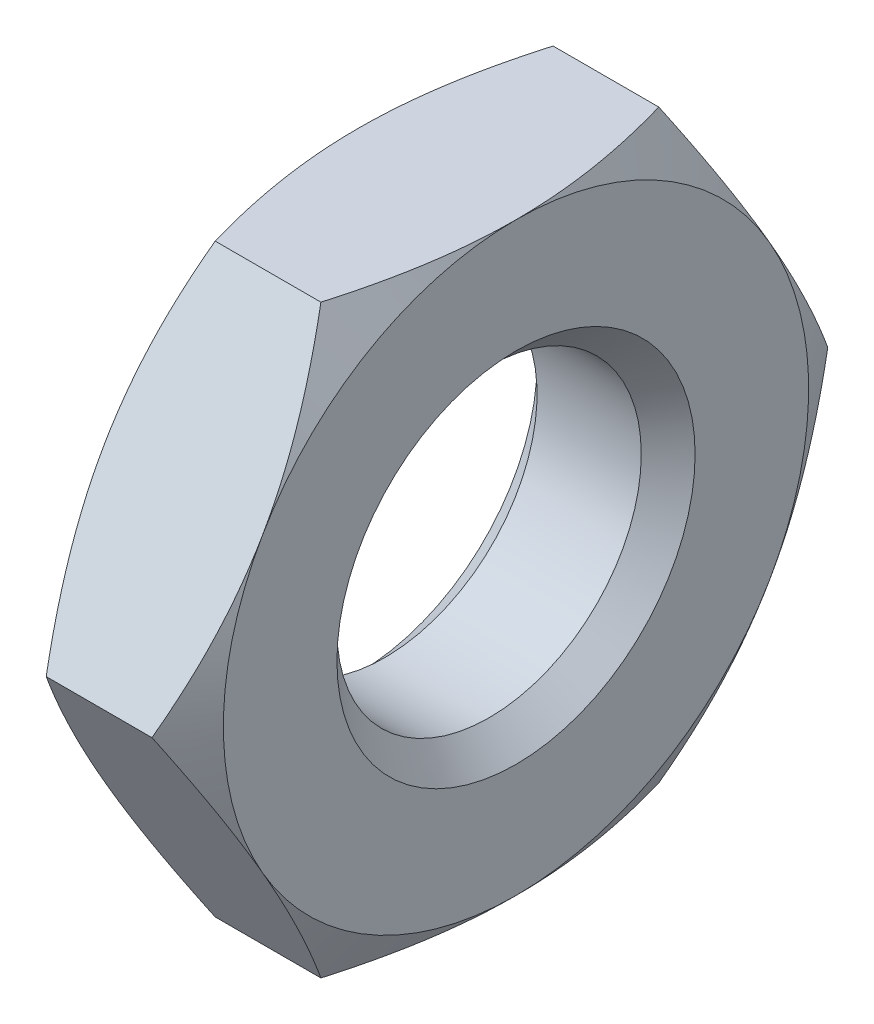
ISO-10303-21;
HEADER;
FILE_DESCRIPTION(('STEP AP214'),'2;1');
FILE_NAME('part.step','',(''),(''),'','','');
FILE_SCHEMA(('AUTOMOTIVE_DESIGN { 1 0 10303 214 1 1 1 1 }'));
ENDSEC;
DATA;
#1=APPLICATION_CONTEXT('core data for automotive mechanical design processes');
#2=APPLICATION_PROTOCOL_DEFINITION('international standard','automotive_design',2000,#1);
#3=PRODUCT_CONTEXT('',#1,'mechanical');
#4=PRODUCT('Part','Part','',(#3));
#5=PRODUCT_RELATED_PRODUCT_CATEGORY('part','',(#4));
#6=PRODUCT_DEFINITION_FORMATION('','',#4);
#7=PRODUCT_DEFINITION_CONTEXT('part definition',#1,'design');
#8=PRODUCT_DEFINITION('design','',#6,#7);
#9=PRODUCT_DEFINITION_SHAPE('','',#8);
#10=(LENGTH_UNIT() NAMED_UNIT(*) SI_UNIT(.MILLI.,.METRE.));
#11=(NAMED_UNIT(*) PLANE_ANGLE_UNIT() SI_UNIT($,.RADIAN.));
#12=(NAMED_UNIT(*) SI_UNIT($,.STERADIAN.) SOLID_ANGLE_UNIT());
#13=UNCERTAINTY_MEASURE_WITH_UNIT(LENGTH_MEASURE(1.E-05),#10,'distance_accuracy_value','');
#14=(GEOMETRIC_REPRESENTATION_CONTEXT(3) GLOBAL_UNCERTAINTY_ASSIGNED_CONTEXT((#13)) GLOBAL_UNIT_ASSIGNED_CONTEXT((#10,
#11,#12)) REPRESENTATION_CONTEXT('',''));
#15=CARTESIAN_POINT('',(0.,0.,0.));
#16=DIRECTION('',(0.,0.,1.));
#17=DIRECTION('',(1.,0.,0.));
#18=AXIS2_PLACEMENT_3D('',#15,#16,#17);
#19=CARTESIAN_POINT('',(1.35,2.5,-1.44337567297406));
#20=DIRECTION('',(1.,0.,0.));
#21=DIRECTION('',(0.,0.,-1.));
#22=AXIS2_PLACEMENT_3D('',#19,#20,#21);
#23=PLANE('',#22);
#24=CARTESIAN_POINT('',(1.35,0.,0.));
#25=DIRECTION('',(1.,0.,0.));
#26=DIRECTION('',(0.,0.,-1.));
#27=AXIS2_PLACEMENT_3D('',#24,#25,#26);
#28=CIRCLE('',#27,1.53);
#29=CARTESIAN_POINT('',(1.35,0.,-1.53));
#30=VERTEX_POINT('',#29);
#31=EDGE_CURVE('E11',#30,#30,#28,.F.);
#32=ORIENTED_EDGE('',*,*,#31,.T.);
#33=EDGE_LOOP('',(#32));
#34=FACE_BOUND('',#33,.T.);
#35=CARTESIAN_POINT('',(1.35,0.,0.));
#36=DIRECTION('',(1.,0.,0.));
#37=DIRECTION('',(0.,0.,-1.));
#38=AXIS2_PLACEMENT_3D('',#35,#36,#37);
#39=CIRCLE('',#38,2.5);
#40=CARTESIAN_POINT('',(1.35,-2.5,0.));
#41=VERTEX_POINT('',#40);
#42=CARTESIAN_POINT('',(1.35,-1.25,-2.1650635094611));
#43=VERTEX_POINT('',#42);
#44=EDGE_CURVE('E142',#41,#43,#39,.T.);
#45=ORIENTED_EDGE('',*,*,#44,.T.);
#46=CARTESIAN_POINT('',(1.35,1.25,-2.1650635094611));
#47=VERTEX_POINT('',#46);
#48=EDGE_CURVE('E130',#43,#47,#39,.T.);
#49=ORIENTED_EDGE('',*,*,#48,.T.);
#50=CARTESIAN_POINT('',(1.35,2.5,0.));
#51=VERTEX_POINT('',#50);
#52=EDGE_CURVE('E144',#47,#51,#39,.T.);
#53=ORIENTED_EDGE('',*,*,#52,.T.);
#54=CARTESIAN_POINT('',(1.35,1.25,2.1650635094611));
#55=VERTEX_POINT('',#54);
#56=EDGE_CURVE('E55',#51,#55,#39,.T.);
#57=ORIENTED_EDGE('',*,*,#56,.T.);
#58=CARTESIAN_POINT('',(1.35,-1.25,2.1650635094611));
#59=VERTEX_POINT('',#58);
#60=EDGE_CURVE('E63',#55,#59,#39,.T.);
#61=ORIENTED_EDGE('',*,*,#60,.T.);
#62=EDGE_CURVE('E166',#59,#41,#39,.T.);
#63=ORIENTED_EDGE('',*,*,#62,.T.);
#64=EDGE_LOOP('',(#45,#49,#53,#57,#61,#63));
#65=FACE_BOUND('',#64,.T.);
#66=ADVANCED_FACE('F39',(#34,#65),#23,.T.);
#67=CARTESIAN_POINT('',(0.,2.5,-1.44337567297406));
#68=DIRECTION('',(1.,0.,0.));
#69=DIRECTION('',(0.,0.,-1.));
#70=AXIS2_PLACEMENT_3D('',#67,#68,#69);
#71=PLANE('',#70);
#72=CARTESIAN_POINT('',(0.,0.,0.));
#73=DIRECTION('',(1.,0.,0.));
#74=DIRECTION('',(0.,0.,-1.));
#75=AXIS2_PLACEMENT_3D('',#72,#73,#74);
#76=CIRCLE('',#75,1.53);
#77=CARTESIAN_POINT('',(0.,0.,-1.53));
#78=VERTEX_POINT('',#77);
#79=EDGE_CURVE('E164',#78,#78,#76,.T.);
#80=ORIENTED_EDGE('',*,*,#79,.T.);
#81=EDGE_LOOP('',(#80));
#82=FACE_BOUND('',#81,.T.);
#83=CARTESIAN_POINT('',(0.,0.,0.));
#84=DIRECTION('',(1.,0.,0.));
#85=DIRECTION('',(0.,0.,-1.));
#86=AXIS2_PLACEMENT_3D('',#83,#84,#85);
#87=CIRCLE('',#86,2.5);
#88=CARTESIAN_POINT('',(0.,-1.25,-2.1650635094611));
#89=VERTEX_POINT('',#88);
#90=CARTESIAN_POINT('',(0.,1.25,-2.1650635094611));
#91=VERTEX_POINT('',#90);
#92=EDGE_CURVE('E173',#89,#91,#87,.T.);
#93=ORIENTED_EDGE('',*,*,#92,.F.);
#94=CARTESIAN_POINT('',(0.,-2.5,0.));
#95=VERTEX_POINT('',#94);
#96=EDGE_CURVE('E320',#95,#89,#87,.T.);
#97=ORIENTED_EDGE('',*,*,#96,.F.);
#98=CARTESIAN_POINT('',(0.,-1.25,2.1650635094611));
#99=VERTEX_POINT('',#98);
#100=EDGE_CURVE('E323',#99,#95,#87,.T.);
#101=ORIENTED_EDGE('',*,*,#100,.F.);
#102=CARTESIAN_POINT('',(0.,1.25,2.1650635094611));
#103=VERTEX_POINT('',#102);
#104=EDGE_CURVE('E329',#103,#99,#87,.T.);
#105=ORIENTED_EDGE('',*,*,#104,.F.);
#106=CARTESIAN_POINT('',(0.,2.5,0.));
#107=VERTEX_POINT('',#106);
#108=EDGE_CURVE('E178',#107,#103,#87,.T.);
#109=ORIENTED_EDGE('',*,*,#108,.F.);
#110=EDGE_CURVE('E174',#91,#107,#87,.T.);
#111=ORIENTED_EDGE('',*,*,#110,.F.);
#112=EDGE_LOOP('',(#93,#97,#101,#105,#109,#111));
#113=FACE_BOUND('',#112,.T.);
#114=ADVANCED_FACE('F321',(#82,#113),#71,.F.);
#115=CARTESIAN_POINT('',(1.35,0.,0.));
#116=DIRECTION('',(-1.,0.,0.));
#117=DIRECTION('',(0.,0.,1.));
#118=AXIS2_PLACEMENT_3D('',#115,#116,#117);
#119=CYLINDRICAL_SURFACE('',#118,1.3);
#120=CARTESIAN_POINT('',(0.229999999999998,0.,0.));
#121=DIRECTION('',(1.,0.,0.));
#122=DIRECTION('',(0.,0.,-1.));
#123=AXIS2_PLACEMENT_3D('',#120,#121,#122);
#124=CIRCLE('',#123,1.3);
#125=CARTESIAN_POINT('',(0.229999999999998,0.,1.3));
#126=VERTEX_POINT('',#125);
#127=EDGE_CURVE('E48',#126,#126,#124,.F.);
#128=CARTESIAN_POINT('',(1.12,0.,0.));
#129=DIRECTION('',(1.,0.,0.));
#130=DIRECTION('',(0.,0.,-1.));
#131=AXIS2_PLACEMENT_3D('',#128,#129,#130);
#132=CIRCLE('',#131,1.3);
#133=CARTESIAN_POINT('',(1.12,0.,1.3));
#134=VERTEX_POINT('',#133);
#135=EDGE_CURVE('E410',#134,#134,#132,.T.);
#136=CARTESIAN_POINT('',(0.229999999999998,0.,1.3));
#137=CARTESIAN_POINT('',(0.239270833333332,0.,1.3));
#138=CARTESIAN_POINT('',(0.248541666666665,0.,1.3));
#139=CARTESIAN_POINT('',(0.267083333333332,0.,1.3));
#140=CARTESIAN_POINT('',(0.276354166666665,0.,1.3));
#141=CARTESIAN_POINT('',(0.294895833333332,0.,1.3));
#142=CARTESIAN_POINT('',(0.304166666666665,0.,1.3));
#143=CARTESIAN_POINT('',(0.322708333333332,0.,1.3));
#144=CARTESIAN_POINT('',(0.331979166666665,0.,1.3));
#145=CARTESIAN_POINT('',(0.350520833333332,0.,1.3));
#146=CARTESIAN_POINT('',(0.359791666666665,0.,1.3));
#147=CARTESIAN_POINT('',(0.378333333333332,0.,1.3));
#148=CARTESIAN_POINT('',(0.387604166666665,0.,1.3));
#149=CARTESIAN_POINT('',(0.406145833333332,0.,1.3));
#150=CARTESIAN_POINT('',(0.415416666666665,0.,1.3));
#151=CARTESIAN_POINT('',(0.433958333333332,0.,1.3));
#152=CARTESIAN_POINT('',(0.443229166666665,0.,1.3));
#153=CARTESIAN_POINT('',(0.461770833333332,0.,1.3));
#154=CARTESIAN_POINT('',(0.471041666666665,0.,1.3));
#155=CARTESIAN_POINT('',(0.489583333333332,0.,1.3));
#156=CARTESIAN_POINT('',(0.498854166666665,0.,1.3));
#157=CARTESIAN_POINT('',(0.517395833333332,0.,1.3));
#158=CARTESIAN_POINT('',(0.526666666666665,0.,1.3));
#159=CARTESIAN_POINT('',(0.545208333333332,0.,1.3));
#160=CARTESIAN_POINT('',(0.554479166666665,0.,1.3));
#161=CARTESIAN_POINT('',(0.573020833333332,0.,1.3));
#162=CARTESIAN_POINT('',(0.582291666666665,0.,1.3));
#163=CARTESIAN_POINT('',(0.600833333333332,0.,1.3));
#164=CARTESIAN_POINT('',(0.610104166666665,0.,1.3));
#165=CARTESIAN_POINT('',(0.628645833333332,0.,1.3));
#166=CARTESIAN_POINT('',(0.637916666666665,0.,1.3));
#167=CARTESIAN_POINT('',(0.656458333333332,0.,1.3));
#168=CARTESIAN_POINT('',(0.665729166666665,0.,1.3));
#169=CARTESIAN_POINT('',(0.684270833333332,0.,1.3));
#170=CARTESIAN_POINT('',(0.693541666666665,0.,1.3));
#171=CARTESIAN_POINT('',(0.712083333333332,0.,1.3));
#172=CARTESIAN_POINT('',(0.721354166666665,0.,1.3));
#173=CARTESIAN_POINT('',(0.739895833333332,0.,1.3));
#174=CARTESIAN_POINT('',(0.749166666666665,0.,1.3));
#175=CARTESIAN_POINT('',(0.767708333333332,0.,1.3));
#176=CARTESIAN_POINT('',(0.776979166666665,0.,1.3));
#177=CARTESIAN_POINT('',(0.795520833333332,0.,1.3));
#178=CARTESIAN_POINT('',(0.804791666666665,0.,1.3));
#179=CARTESIAN_POINT('',(0.823333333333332,0.,1.3));
#180=CARTESIAN_POINT('',(0.832604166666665,0.,1.3));
#181=CARTESIAN_POINT('',(0.851145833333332,0.,1.3));
#182=CARTESIAN_POINT('',(0.860416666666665,0.,1.3));
#183=CARTESIAN_POINT('',(0.878958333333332,0.,1.3));
#184=CARTESIAN_POINT('',(0.888229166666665,0.,1.3));
#185=CARTESIAN_POINT('',(0.906770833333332,0.,1.3));
#186=CARTESIAN_POINT('',(0.916041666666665,0.,1.3));
#187=CARTESIAN_POINT('',(0.934583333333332,0.,1.3));
#188=CARTESIAN_POINT('',(0.943854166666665,0.,1.3));
#189=CARTESIAN_POINT('',(0.962395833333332,0.,1.3));
#190=CARTESIAN_POINT('',(0.971666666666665,0.,1.3));
#191=CARTESIAN_POINT('',(0.990208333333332,0.,1.3));
#192=CARTESIAN_POINT('',(0.999479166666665,0.,1.3));
#193=CARTESIAN_POINT('',(1.01802083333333,0.,1.3));
#194=CARTESIAN_POINT('',(1.02729166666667,0.,1.3));
#195=CARTESIAN_POINT('',(1.04583333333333,0.,1.3));
#196=CARTESIAN_POINT('',(1.05510416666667,0.,1.3));
#197=CARTESIAN_POINT('',(1.07364583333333,0.,1.3));
#198=CARTESIAN_POINT('',(1.08291666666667,0.,1.3));
#199=CARTESIAN_POINT('',(1.10145833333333,0.,1.3));
#200=CARTESIAN_POINT('',(1.11072916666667,0.,1.3));
#201=CARTESIAN_POINT('',(1.12,0.,1.3));
#202=B_SPLINE_CURVE_WITH_KNOTS('',3,(#136,#137,#138,#139,#140,#141,#142,#143,#144,#145,#146,
#147,#148,#149,#150,#151,#152,#153,#154,#155,#156,#157,#158,#159,#160,#161,#162,#163,#164,#165,
#166,#167,#168,#169,#170,#171,#172,#173,#174,#175,#176,#177,#178,#179,#180,#181,#182,#183,#184,
#185,#186,#187,#188,#189,#190,#191,#192,#193,#194,#195,#196,#197,#198,#199,#200,#201),
.UNSPECIFIED.,.F.,.F.,(4,2,2,2,2,2,2,2,2,2,2,2,2,2,2,2,2,2,2,2,2,2,2,2,2,2,2,2,2,2,2,2,4),(0.,
0.0278125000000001,0.0556250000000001,0.0834375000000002,0.11125,0.1390625,0.166875,0.1946875,
0.2225,0.2503125,0.278125,0.3059375,0.33375,0.3615625,0.389375,0.4171875,0.445,0.4728125,
0.500625,0.5284375,0.55625,0.5840625,0.611875,0.639687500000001,0.6675,0.6953125,0.723125,
0.7509375,0.778750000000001,0.806562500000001,0.834375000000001,0.862187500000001,
0.890000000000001),.UNSPECIFIED.);
#203=EDGE_CURVE('BSEAM234',#126,#134,#202,.T.);
#204=ORIENTED_EDGE('',*,*,#127,.T.);
#205=ORIENTED_EDGE('',*,*,#135,.T.);
#206=ORIENTED_EDGE('',*,*,#203,.T.);
#207=ORIENTED_EDGE('',*,*,#203,.F.);
#208=EDGE_LOOP('',(#204,#206,#205,#207));
#209=FACE_BOUND('',#208,.T.);
#210=ADVANCED_FACE('F234',(#209),#119,.F.);
#211=CARTESIAN_POINT('',(0.,0.,0.));
#212=DIRECTION('',(1.,0.,0.));
#213=DIRECTION('',(0.,0.,-1.));
#214=AXIS2_PLACEMENT_3D('',#211,#212,#213);
#215=CONICAL_SURFACE('',#214,2.5,1.0471975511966);
#216=CARTESIAN_POINT('',(0.223357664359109,-2.5002,-1.44326020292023));
#217=CARTESIAN_POINT('',(0.186721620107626,-2.39033676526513,-1.50668977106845));
#218=CARTESIAN_POINT('',(0.153402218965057,-2.27952520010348,-1.57066685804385));
#219=CARTESIAN_POINT('',(0.0952422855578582,-2.05598316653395,-1.69972891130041));
#220=CARTESIAN_POINT('',(0.0704223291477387,-1.94324872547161,-1.7648161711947));
#221=CARTESIAN_POINT('',(0.0317856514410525,-1.71917700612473,-1.8941840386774));
#222=CARTESIAN_POINT('',(0.0177117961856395,-1.60787420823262,-1.95844473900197));
#223=CARTESIAN_POINT('',(0.000909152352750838,-1.38474477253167,-2.08726857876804));
#224=CARTESIAN_POINT('',(-0.00183354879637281,-1.27291894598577,-2.15183124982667));
#225=CARTESIAN_POINT('',(0.0038657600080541,-1.06395802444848,-2.27247489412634));
#226=CARTESIAN_POINT('',(0.0109083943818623,-0.966791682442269,-2.32857390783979));
#227=CARTESIAN_POINT('',(0.033231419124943,-0.773092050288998,-2.44040644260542));
#228=CARTESIAN_POINT('',(0.0485194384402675,-0.676559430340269,-2.4961395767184));
#229=CARTESIAN_POINT('',(0.0867390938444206,-0.482460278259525,-2.60820277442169));
#230=CARTESIAN_POINT('',(0.109832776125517,-0.384918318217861,-2.66451865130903));
#231=CARTESIAN_POINT('',(0.162246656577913,-0.191289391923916,-2.77631036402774));
#232=CARTESIAN_POINT('',(0.191554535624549,-0.0951999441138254,-2.83178763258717));
#233=CARTESIAN_POINT('',(0.223357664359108,0.000199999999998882,-2.88686681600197));
#234=B_SPLINE_CURVE_WITH_KNOTS('',3,(#216,#217,#218,#219,#220,#221,#222,#223,#224,#225,#226,
#227,#228,#229,#230,#231,#232,#233),.UNSPECIFIED.,.F.,.F.,(4,2,2,2,2,2,2,2,4),(0.,
0.396285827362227,0.793524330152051,1.18093086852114,1.56786160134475,1.90479741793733,
2.24204551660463,2.58677531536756,2.93082800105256),.UNSPECIFIED.);
#235=CARTESIAN_POINT('',(0.223290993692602,0.,-2.88675134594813));
#236=VERTEX_POINT('',#235);
#237=EDGE_CURVE('E335',#89,#236,#234,.T.);
#238=ORIENTED_EDGE('',*,*,#237,.F.);
#239=ORIENTED_EDGE('',*,*,#92,.T.);
#240=CARTESIAN_POINT('',(0.223357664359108,-0.000200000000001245,-2.88686681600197));
#241=CARTESIAN_POINT('',(0.186721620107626,0.10966323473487,-2.82343724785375));
#242=CARTESIAN_POINT('',(0.153402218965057,0.220474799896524,-2.75946016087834));
#243=CARTESIAN_POINT('',(0.095242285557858,0.444016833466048,-2.63039810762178));
#244=CARTESIAN_POINT('',(0.0704223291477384,0.556751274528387,-2.5653108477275));
#245=CARTESIAN_POINT('',(0.0317856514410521,0.780822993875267,-2.43594298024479));
#246=CARTESIAN_POINT('',(0.0177117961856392,0.892125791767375,-2.37168227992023));
#247=CARTESIAN_POINT('',(0.000909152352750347,1.11525522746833,-2.24285844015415));
#248=CARTESIAN_POINT('',(-0.0018335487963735,1.22708105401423,-2.17829576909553));
#249=CARTESIAN_POINT('',(0.0038657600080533,1.43604197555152,-2.05765212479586));
#250=CARTESIAN_POINT('',(0.0109083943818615,1.53320831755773,-2.0015531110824));
#251=CARTESIAN_POINT('',(0.0332314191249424,1.726907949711,-1.88972057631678));
#252=CARTESIAN_POINT('',(0.0485194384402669,1.82344056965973,-1.8339874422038));
#253=CARTESIAN_POINT('',(0.0867390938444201,2.01753972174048,-1.7219242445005));
#254=CARTESIAN_POINT('',(0.109832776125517,2.11508168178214,-1.66560836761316));
#255=CARTESIAN_POINT('',(0.162246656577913,2.30871060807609,-1.55381665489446));
#256=CARTESIAN_POINT('',(0.191554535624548,2.40480005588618,-1.49833938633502));
#257=CARTESIAN_POINT('',(0.223357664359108,2.5002,-1.44326020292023));
#258=B_SPLINE_CURVE_WITH_KNOTS('',3,(#240,#241,#242,#243,#244,#245,#246,#247,#248,#249,#250,
#251,#252,#253,#254,#255,#256,#257),.UNSPECIFIED.,.F.,.F.,(4,2,2,2,2,2,2,2,4),(0.,
0.396285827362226,0.793524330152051,1.18093086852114,1.56786160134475,1.90479741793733,
2.24204551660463,2.58677531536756,2.93082800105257),.UNSPECIFIED.);
#259=EDGE_CURVE('E215',#236,#91,#258,.T.);
#260=ORIENTED_EDGE('',*,*,#259,.F.);
#261=EDGE_LOOP('',(#238,#239,#260));
#262=FACE_BOUND('',#261,.T.);
#263=ADVANCED_FACE('F194',(#262),#215,.T.);
#264=ORIENTED_EDGE('',*,*,#96,.T.);
#265=CARTESIAN_POINT('',(0.223290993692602,-2.5,-1.44337567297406));
#266=VERTEX_POINT('',#265);
#267=EDGE_CURVE('E156',#266,#89,#234,.T.);
#268=ORIENTED_EDGE('',*,*,#267,.F.);
#269=CARTESIAN_POINT('',(1.22684899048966,-2.5,-3.89105374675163));
#270=CARTESIAN_POINT('',(1.17376935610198,-2.5,-3.78174691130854));
#271=CARTESIAN_POINT('',(1.12119463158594,-2.5,-3.67219065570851));
#272=CARTESIAN_POINT('',(1.01733868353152,-2.5,-3.45244672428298));
#273=CARTESIAN_POINT('',(0.966057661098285,-2.5,-3.34225895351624));
#274=CARTESIAN_POINT('',(0.864817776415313,-2.5,-3.12055834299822));
#275=CARTESIAN_POINT('',(0.814867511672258,-2.5,-3.00904156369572));
#276=CARTESIAN_POINT('',(0.716992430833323,-2.5,-2.7851259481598));
#277=CARTESIAN_POINT('',(0.669067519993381,-2.5,-2.67272715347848));
#278=CARTESIAN_POINT('',(0.574254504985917,-2.5,-2.44318186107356));
#279=CARTESIAN_POINT('',(0.527451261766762,-2.5,-2.32600012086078));
#280=CARTESIAN_POINT('',(0.437353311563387,-2.5,-2.09027081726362));
#281=CARTESIAN_POINT('',(0.39405899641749,-2.5,-1.97172310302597));
#282=CARTESIAN_POINT('',(0.312105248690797,-2.5,-1.73329071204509));
#283=CARTESIAN_POINT('',(0.273436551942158,-2.5,-1.61340925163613));
#284=CARTESIAN_POINT('',(0.201965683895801,-2.5,-1.37192659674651));
#285=CARTESIAN_POINT('',(0.169161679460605,-2.5,-1.25032595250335));
#286=CARTESIAN_POINT('',(0.111161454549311,-2.5,-1.00601685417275));
#287=CARTESIAN_POINT('',(0.0859232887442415,-2.5,-0.883318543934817));
#288=CARTESIAN_POINT('',(0.0444701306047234,-2.5,-0.636381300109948));
#289=CARTESIAN_POINT('',(0.0282542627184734,-2.5,-0.512142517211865));
#290=CARTESIAN_POINT('',(0.0063510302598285,-2.5,-0.264373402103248));
#291=CARTESIAN_POINT('',(0.000527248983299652,-2.5,-0.140855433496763));
#292=CARTESIAN_POINT('',(-0.000458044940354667,-2.5,0.106233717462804));
#293=CARTESIAN_POINT('',(0.0043806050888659,-2.5,0.229804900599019));
#294=CARTESIAN_POINT('',(0.0212689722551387,-2.5,0.439180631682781));
#295=CARTESIAN_POINT('',(0.0307237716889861,-2.5,0.525207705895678));
#296=CARTESIAN_POINT('',(0.0542196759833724,-2.5,0.696639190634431));
#297=CARTESIAN_POINT('',(0.0682613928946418,-2.5,0.782043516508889));
#298=CARTESIAN_POINT('',(0.116531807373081,-2.5,1.0371936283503));
#299=CARTESIAN_POINT('',(0.156897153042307,-2.5,1.20578228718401));
#300=CARTESIAN_POINT('',(0.250636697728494,-2.5,1.543210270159));
#301=CARTESIAN_POINT('',(0.304280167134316,-2.5,1.71197183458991));
#302=CARTESIAN_POINT('',(0.391294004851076,-2.5,1.96276872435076));
#303=CARTESIAN_POINT('',(0.421386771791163,-2.5,2.04596870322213));
#304=CARTESIAN_POINT('',(0.483412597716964,-2.5,2.2116797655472));
#305=CARTESIAN_POINT('',(0.515345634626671,-2.5,2.29419085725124));
#306=CARTESIAN_POINT('',(0.593055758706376,-2.5,2.48955705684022));
#307=CARTESIAN_POINT('',(0.63951800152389,-2.5,2.60213884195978));
#308=CARTESIAN_POINT('',(0.734728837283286,-2.5,2.8263339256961));
#309=CARTESIAN_POINT('',(0.783477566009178,-2.5,2.9379471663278));
#310=CARTESIAN_POINT('',(0.93244011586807,-2.5,3.27162573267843));
#311=CARTESIAN_POINT('',(1.03535190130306,-2.5,3.49248482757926));
#312=CARTESIAN_POINT('',(1.24592945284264,-2.5,3.93218255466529));
#313=CARTESIAN_POINT('',(1.35360006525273,-2.5,4.15101883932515));
#314=CARTESIAN_POINT('',(1.57212757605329,-2.5,4.58710086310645));
#315=CARTESIAN_POINT('',(1.68298459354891,-2.5,4.80434654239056));
#316=CARTESIAN_POINT('',(1.89746112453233,-2.5,5.21932476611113));
#317=CARTESIAN_POINT('',(2.00089851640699,-2.5,5.41715177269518));
#318=CARTESIAN_POINT('',(2.20918900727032,-2.5,5.81206751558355));
#319=CARTESIAN_POINT('',(2.3140421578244,-2.5,6.00915622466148));
#320=CARTESIAN_POINT('',(2.52455741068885,-2.5,6.40225546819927));
#321=CARTESIAN_POINT('',(2.63021677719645,-2.5,6.59826746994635));
#322=CARTESIAN_POINT('',(2.8423801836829,-2.5,6.98981967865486));
#323=CARTESIAN_POINT('',(2.94888417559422,-2.5,7.18535991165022));
#324=CARTESIAN_POINT('',(3.05570303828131,-2.5,7.38072677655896));
#325=B_SPLINE_CURVE_WITH_KNOTS('',3,(#269,#270,#271,#272,#273,#274,#275,#276,#277,#278,#279,
#280,#281,#282,#283,#284,#285,#286,#287,#288,#289,#290,#291,#292,#293,#294,#295,#296,#297,#298,
#299,#300,#301,#302,#303,#304,#305,#306,#307,#308,#309,#310,#311,#312,#313,#314,#315,#316,#317,
#318,#319,#320,#321,#322,#323,#324),.UNSPECIFIED.,.F.,.F.,(4,2,2,2,2,2,2,2,2,2,2,2,2,2,2,2,2,2,
2,2,2,2,2,2,2,2,2,4),(0.,0.364543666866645,0.729143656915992,1.09570519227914,1.46224956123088,
1.8407545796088,2.21930180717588,2.59707771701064,2.97473533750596,3.35025874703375,
3.7257457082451,4.09626635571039,4.46679265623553,4.72630326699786,4.98584851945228,
5.50522166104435,6.03614190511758,6.3015497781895,6.56695446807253,6.9322983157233,
7.29766388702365,8.02854100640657,8.76018040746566,9.49184719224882,10.1615519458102,
10.831281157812,11.4993069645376,12.1672950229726),.UNSPECIFIED.);
#326=EDGE_CURVE('E177',#95,#266,#325,.F.);
#327=ORIENTED_EDGE('',*,*,#326,.F.);
#328=EDGE_LOOP('',(#264,#268,#327));
#329=FACE_BOUND('',#328,.T.);
#330=ADVANCED_FACE('F352',(#329),#215,.T.);
#331=CARTESIAN_POINT('',(0.675,0.,0.));
#332=DIRECTION('',(-1.,0.,0.));
#333=DIRECTION('',(0.,0.,1.));
#334=AXIS2_PLACEMENT_3D('',#331,#332,#333);
#335=CONICAL_SURFACE('',#334,3.669134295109,1.0471975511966);
#336=CARTESIAN_POINT('',(1.12664233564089,0.000199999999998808,-2.88686681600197));
#337=CARTESIAN_POINT('',(1.16327837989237,-0.109663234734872,-2.82343724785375));
#338=CARTESIAN_POINT('',(1.19659778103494,-0.220474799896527,-2.75946016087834));
#339=CARTESIAN_POINT('',(1.25475771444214,-0.444016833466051,-2.63039810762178));
#340=CARTESIAN_POINT('',(1.27957767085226,-0.55675127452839,-2.5653108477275));
#341=CARTESIAN_POINT('',(1.31821434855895,-0.78082299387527,-2.43594298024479));
#342=CARTESIAN_POINT('',(1.33228820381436,-0.892125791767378,-2.37168227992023));
#343=CARTESIAN_POINT('',(1.34909084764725,-1.11525522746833,-2.24285844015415));
#344=CARTESIAN_POINT('',(1.35183354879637,-1.22708105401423,-2.17829576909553));
#345=CARTESIAN_POINT('',(1.34613423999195,-1.43604197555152,-2.05765212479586));
#346=CARTESIAN_POINT('',(1.33909160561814,-1.53320831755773,-2.0015531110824));
#347=CARTESIAN_POINT('',(1.31676858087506,-1.726907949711,-1.88972057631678));
#348=CARTESIAN_POINT('',(1.30148056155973,-1.82344056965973,-1.8339874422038));
#349=CARTESIAN_POINT('',(1.26326090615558,-2.01753972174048,-1.7219242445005));
#350=CARTESIAN_POINT('',(1.24016722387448,-2.11508168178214,-1.66560836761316));
#351=CARTESIAN_POINT('',(1.18775334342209,-2.30871060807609,-1.55381665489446));
#352=CARTESIAN_POINT('',(1.15844546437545,-2.40480005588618,-1.49833938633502));
#353=CARTESIAN_POINT('',(1.12664233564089,-2.5002,-1.44326020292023));
#354=B_SPLINE_CURVE_WITH_KNOTS('',3,(#336,#337,#338,#339,#340,#341,#342,#343,#344,#345,#346,
#347,#348,#349,#350,#351,#352,#353),.UNSPECIFIED.,.F.,.F.,(4,2,2,2,2,2,2,2,4),(0.,
0.396285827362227,0.793524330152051,1.18093086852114,1.56786160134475,1.90479741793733,
2.24204551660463,2.58677531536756,2.93082800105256),.UNSPECIFIED.);
#355=CARTESIAN_POINT('',(1.1267090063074,-2.5,-1.44337567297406));
#356=VERTEX_POINT('',#355);
#357=EDGE_CURVE('E147',#43,#356,#354,.T.);
#358=ORIENTED_EDGE('',*,*,#357,.F.);
#359=ORIENTED_EDGE('',*,*,#44,.F.);
#360=CARTESIAN_POINT('',(0.123151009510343,-2.5,-3.89105374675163));
#361=CARTESIAN_POINT('',(0.176230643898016,-2.5,-3.78174691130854));
#362=CARTESIAN_POINT('',(0.228805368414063,-2.5,-3.67219065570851));
#363=CARTESIAN_POINT('',(0.33266131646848,-2.5,-3.45244672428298));
#364=CARTESIAN_POINT('',(0.383942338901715,-2.5,-3.34225895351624));
#365=CARTESIAN_POINT('',(0.485182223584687,-2.5,-3.12055834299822));
#366=CARTESIAN_POINT('',(0.535132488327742,-2.5,-3.00904156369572));
#367=CARTESIAN_POINT('',(0.633007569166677,-2.5,-2.7851259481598));
#368=CARTESIAN_POINT('',(0.680932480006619,-2.5,-2.67272715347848));
#369=CARTESIAN_POINT('',(0.775745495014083,-2.5,-2.44318186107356));
#370=CARTESIAN_POINT('',(0.822548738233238,-2.5,-2.32600012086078));
#371=CARTESIAN_POINT('',(0.912646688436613,-2.5,-2.09027081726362));
#372=CARTESIAN_POINT('',(0.95594100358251,-2.5,-1.97172310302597));
#373=CARTESIAN_POINT('',(1.0378947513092,-2.5,-1.73329071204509));
#374=CARTESIAN_POINT('',(1.07656344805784,-2.5,-1.61340925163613));
#375=CARTESIAN_POINT('',(1.1480343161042,-2.5,-1.3719265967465));
#376=CARTESIAN_POINT('',(1.18083832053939,-2.5,-1.25032595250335));
#377=CARTESIAN_POINT('',(1.23883854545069,-2.5,-1.00601685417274));
#378=CARTESIAN_POINT('',(1.26407671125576,-2.5,-0.883318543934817));
#379=CARTESIAN_POINT('',(1.30552986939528,-2.5,-0.636381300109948));
#380=CARTESIAN_POINT('',(1.32174573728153,-2.5,-0.512142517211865));
#381=CARTESIAN_POINT('',(1.34364896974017,-2.5,-0.264373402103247));
#382=CARTESIAN_POINT('',(1.3494727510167,-2.5,-0.140855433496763));
#383=CARTESIAN_POINT('',(1.35045804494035,-2.5,0.106233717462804));
#384=CARTESIAN_POINT('',(1.34561939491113,-2.5,0.22980490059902));
#385=CARTESIAN_POINT('',(1.32873102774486,-2.5,0.439180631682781));
#386=CARTESIAN_POINT('',(1.31927622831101,-2.5,0.525207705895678));
#387=CARTESIAN_POINT('',(1.29578032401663,-2.5,0.696639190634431));
#388=CARTESIAN_POINT('',(1.28173860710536,-2.5,0.782043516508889));
#389=CARTESIAN_POINT('',(1.23346819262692,-2.5,1.0371936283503));
#390=CARTESIAN_POINT('',(1.19310284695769,-2.5,1.20578228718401));
#391=CARTESIAN_POINT('',(1.09936330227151,-2.5,1.543210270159));
#392=CARTESIAN_POINT('',(1.04571983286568,-2.5,1.71197183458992));
#393=CARTESIAN_POINT('',(0.958705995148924,-2.5,1.96276872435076));
#394=CARTESIAN_POINT('',(0.928613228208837,-2.5,2.04596870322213));
#395=CARTESIAN_POINT('',(0.866587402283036,-2.5,2.2116797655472));
#396=CARTESIAN_POINT('',(0.834654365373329,-2.5,2.29419085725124));
#397=CARTESIAN_POINT('',(0.756944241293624,-2.5,2.48955705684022));
#398=CARTESIAN_POINT('',(0.71048199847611,-2.5,2.60213884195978));
#399=CARTESIAN_POINT('',(0.615271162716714,-2.5,2.8263339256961));
#400=CARTESIAN_POINT('',(0.566522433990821,-2.5,2.93794716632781));
#401=CARTESIAN_POINT('',(0.41755988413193,-2.5,3.27162573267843));
#402=CARTESIAN_POINT('',(0.314648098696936,-2.5,3.49248482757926));
#403=CARTESIAN_POINT('',(0.104070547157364,-2.5,3.93218255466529));
#404=CARTESIAN_POINT('',(-0.00360006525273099,-2.5,4.15101883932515));
#405=CARTESIAN_POINT('',(-0.222127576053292,-2.5,4.58710086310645));
#406=CARTESIAN_POINT('',(-0.332984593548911,-2.5,4.80434654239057));
#407=CARTESIAN_POINT('',(-0.547461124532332,-2.5,5.21932476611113));
#408=CARTESIAN_POINT('',(-0.650898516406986,-2.5,5.41715177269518));
#409=CARTESIAN_POINT('',(-0.85918900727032,-2.5,5.81206751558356));
#410=CARTESIAN_POINT('',(-0.964042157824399,-2.5,6.00915622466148));
#411=CARTESIAN_POINT('',(-1.17455741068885,-2.5,6.40225546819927));
#412=CARTESIAN_POINT('',(-1.28021677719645,-2.5,6.59826746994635));
#413=CARTESIAN_POINT('',(-1.4923801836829,-2.5,6.98981967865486));
#414=CARTESIAN_POINT('',(-1.59888417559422,-2.5,7.18535991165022));
#415=CARTESIAN_POINT('',(-1.70570303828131,-2.5,7.38072677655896));
#416=B_SPLINE_CURVE_WITH_KNOTS('',3,(#360,#361,#362,#363,#364,#365,#366,#367,#368,#369,#370,
#371,#372,#373,#374,#375,#376,#377,#378,#379,#380,#381,#382,#383,#384,#385,#386,#387,#388,#389,
#390,#391,#392,#393,#394,#395,#396,#397,#398,#399,#400,#401,#402,#403,#404,#405,#406,#407,#408,
#409,#410,#411,#412,#413,#414,#415),.UNSPECIFIED.,.F.,.F.,(4,2,2,2,2,2,2,2,2,2,2,2,2,2,2,2,2,2,
2,2,2,2,2,2,2,2,2,4),(0.,0.364543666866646,0.729143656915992,1.09570519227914,1.46224956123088,
1.8407545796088,2.21930180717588,2.59707771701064,2.97473533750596,3.35025874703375,
3.7257457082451,4.09626635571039,4.46679265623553,4.72630326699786,4.98584851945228,
5.50522166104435,6.03614190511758,6.3015497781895,6.56695446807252,6.9322983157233,
7.29766388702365,8.02854100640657,8.76018040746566,9.49184719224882,10.1615519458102,
10.831281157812,11.4993069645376,12.1672950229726),.UNSPECIFIED.);
#417=EDGE_CURVE('E151',#356,#41,#416,.T.);
#418=ORIENTED_EDGE('',*,*,#417,.F.);
#419=EDGE_LOOP('',(#358,#359,#418));
#420=FACE_BOUND('',#419,.T.);
#421=ADVANCED_FACE('F148',(#420),#335,.T.);
#422=ORIENTED_EDGE('',*,*,#48,.F.);
#423=CARTESIAN_POINT('',(1.1267090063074,0.,-2.88675134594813));
#424=VERTEX_POINT('',#423);
#425=EDGE_CURVE('E134',#424,#43,#354,.T.);
#426=ORIENTED_EDGE('',*,*,#425,.F.);
#427=CARTESIAN_POINT('',(1.12664233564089,2.5002,-1.44326020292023));
#428=CARTESIAN_POINT('',(1.16327837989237,2.39033676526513,-1.50668977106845));
#429=CARTESIAN_POINT('',(1.19659778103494,2.27952520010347,-1.57066685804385));
#430=CARTESIAN_POINT('',(1.25475771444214,2.05598316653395,-1.69972891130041));
#431=CARTESIAN_POINT('',(1.27957767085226,1.94324872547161,-1.7648161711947));
#432=CARTESIAN_POINT('',(1.31821434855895,1.71917700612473,-1.8941840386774));
#433=CARTESIAN_POINT('',(1.33228820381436,1.60787420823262,-1.95844473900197));
#434=CARTESIAN_POINT('',(1.34909084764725,1.38474477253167,-2.08726857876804));
#435=CARTESIAN_POINT('',(1.35183354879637,1.27291894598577,-2.15183124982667));
#436=CARTESIAN_POINT('',(1.34613423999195,1.06395802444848,-2.27247489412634));
#437=CARTESIAN_POINT('',(1.33909160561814,0.966791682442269,-2.32857390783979));
#438=CARTESIAN_POINT('',(1.31676858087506,0.773092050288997,-2.44040644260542));
#439=CARTESIAN_POINT('',(1.30148056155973,0.676559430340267,-2.49613957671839));
#440=CARTESIAN_POINT('',(1.26326090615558,0.482460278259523,-2.60820277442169));
#441=CARTESIAN_POINT('',(1.24016722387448,0.384918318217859,-2.66451865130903));
#442=CARTESIAN_POINT('',(1.18775334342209,0.191289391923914,-2.77631036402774));
#443=CARTESIAN_POINT('',(1.15844546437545,0.0951999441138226,-2.83178763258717));
#444=CARTESIAN_POINT('',(1.12664233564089,-0.000200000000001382,-2.88686681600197));
#445=B_SPLINE_CURVE_WITH_KNOTS('',3,(#427,#428,#429,#430,#431,#432,#433,#434,#435,#436,#437,
#438,#439,#440,#441,#442,#443,#444),.UNSPECIFIED.,.F.,.F.,(4,2,2,2,2,2,2,2,4),(0.,
0.396285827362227,0.793524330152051,1.18093086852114,1.56786160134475,1.90479741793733,
2.24204551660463,2.58677531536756,2.93082800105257),.UNSPECIFIED.);
#446=EDGE_CURVE('E136',#47,#424,#445,.T.);
#447=ORIENTED_EDGE('',*,*,#446,.F.);
#448=EDGE_LOOP('',(#422,#426,#447));
#449=FACE_BOUND('',#448,.T.);
#450=ADVANCED_FACE('F132',(#449),#335,.T.);
#451=ORIENTED_EDGE('',*,*,#100,.T.);
#452=CARTESIAN_POINT('',(0.223290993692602,-2.5,1.44337567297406));
#453=VERTEX_POINT('',#452);
#454=EDGE_CURVE('E187',#453,#95,#325,.F.);
#455=ORIENTED_EDGE('',*,*,#454,.F.);
#456=CARTESIAN_POINT('',(0.223357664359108,0.00020000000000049,2.88686681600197));
#457=CARTESIAN_POINT('',(0.186721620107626,-0.109663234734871,2.82343724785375));
#458=CARTESIAN_POINT('',(0.153402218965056,-0.220474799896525,2.75946016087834));
#459=CARTESIAN_POINT('',(0.0952422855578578,-0.444016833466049,2.63039810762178));
#460=CARTESIAN_POINT('',(0.0704223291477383,-0.556751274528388,2.5653108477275));
#461=CARTESIAN_POINT('',(0.0317856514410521,-0.780822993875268,2.43594298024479));
#462=CARTESIAN_POINT('',(0.0177117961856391,-0.892125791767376,2.37168227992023));
#463=CARTESIAN_POINT('',(0.000909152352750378,-1.11525522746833,2.24285844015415));
#464=CARTESIAN_POINT('',(-0.00183354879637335,-1.22708105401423,2.17829576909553));
#465=CARTESIAN_POINT('',(0.00386576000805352,-1.43604197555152,2.05765212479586));
#466=CARTESIAN_POINT('',(0.0109083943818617,-1.53320831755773,2.0015531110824));
#467=CARTESIAN_POINT('',(0.0332314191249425,-1.726907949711,1.88972057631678));
#468=CARTESIAN_POINT('',(0.048519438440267,-1.82344056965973,1.8339874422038));
#469=CARTESIAN_POINT('',(0.0867390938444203,-2.01753972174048,1.7219242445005));
#470=CARTESIAN_POINT('',(0.109832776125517,-2.11508168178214,1.66560836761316));
#471=CARTESIAN_POINT('',(0.162246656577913,-2.30871060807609,1.55381665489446));
#472=CARTESIAN_POINT('',(0.191554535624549,-2.40480005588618,1.49833938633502));
#473=CARTESIAN_POINT('',(0.223357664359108,-2.5002,1.44326020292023));
#474=B_SPLINE_CURVE_WITH_KNOTS('',3,(#456,#457,#458,#459,#460,#461,#462,#463,#464,#465,#466,
#467,#468,#469,#470,#471,#472,#473),.UNSPECIFIED.,.F.,.F.,(4,2,2,2,2,2,2,2,4),(0.,
0.396285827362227,0.793524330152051,1.18093086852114,1.56786160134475,1.90479741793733,
2.24204551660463,2.58677531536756,2.93082800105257),.UNSPECIFIED.);
#475=EDGE_CURVE('E188',#99,#453,#474,.T.);
#476=ORIENTED_EDGE('',*,*,#475,.F.);
#477=EDGE_LOOP('',(#451,#455,#476));
#478=FACE_BOUND('',#477,.T.);
#479=ADVANCED_FACE('F351',(#478),#215,.T.);
#480=CARTESIAN_POINT('',(1.1267090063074,-2.5,1.44337567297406));
#481=VERTEX_POINT('',#480);
#482=EDGE_CURVE('E216',#41,#481,#416,.T.);
#483=ORIENTED_EDGE('',*,*,#482,.F.);
#484=ORIENTED_EDGE('',*,*,#62,.F.);
#485=CARTESIAN_POINT('',(1.12664233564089,-2.5002,1.44326020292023));
#486=CARTESIAN_POINT('',(1.16327837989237,-2.39033676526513,1.50668977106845));
#487=CARTESIAN_POINT('',(1.19659778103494,-2.27952520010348,1.57066685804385));
#488=CARTESIAN_POINT('',(1.25475771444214,-2.05598316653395,1.69972891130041));
#489=CARTESIAN_POINT('',(1.27957767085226,-1.94324872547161,1.7648161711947));
#490=CARTESIAN_POINT('',(1.31821434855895,-1.71917700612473,1.8941840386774));
#491=CARTESIAN_POINT('',(1.33228820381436,-1.60787420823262,1.95844473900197));
#492=CARTESIAN_POINT('',(1.34909084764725,-1.38474477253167,2.08726857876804));
#493=CARTESIAN_POINT('',(1.35183354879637,-1.27291894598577,2.15183124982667));
#494=CARTESIAN_POINT('',(1.34613423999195,-1.06395802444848,2.27247489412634));
#495=CARTESIAN_POINT('',(1.33909160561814,-0.96679168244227,2.32857390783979));
#496=CARTESIAN_POINT('',(1.31676858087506,-0.773092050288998,2.44040644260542));
#497=CARTESIAN_POINT('',(1.30148056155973,-0.676559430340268,2.49613957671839));
#498=CARTESIAN_POINT('',(1.26326090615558,-0.482460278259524,2.60820277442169));
#499=CARTESIAN_POINT('',(1.24016722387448,-0.384918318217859,2.66451865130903));
#500=CARTESIAN_POINT('',(1.18775334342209,-0.191289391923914,2.77631036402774));
#501=CARTESIAN_POINT('',(1.15844546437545,-0.0951999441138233,2.83178763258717));
#502=CARTESIAN_POINT('',(1.12664233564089,0.000200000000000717,2.88686681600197));
#503=B_SPLINE_CURVE_WITH_KNOTS('',3,(#485,#486,#487,#488,#489,#490,#491,#492,#493,#494,#495,
#496,#497,#498,#499,#500,#501,#502),.UNSPECIFIED.,.F.,.F.,(4,2,2,2,2,2,2,2,4),(0.,
0.396285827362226,0.79352433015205,1.18093086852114,1.56786160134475,1.90479741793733,
2.24204551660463,2.58677531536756,2.93082800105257),.UNSPECIFIED.);
#504=EDGE_CURVE('E247',#481,#59,#503,.T.);
#505=ORIENTED_EDGE('',*,*,#504,.F.);
#506=EDGE_LOOP('',(#483,#484,#505));
#507=FACE_BOUND('',#506,.T.);
#508=ADVANCED_FACE('F396',(#507),#335,.T.);
#509=ORIENTED_EDGE('',*,*,#104,.T.);
#510=CARTESIAN_POINT('',(0.223290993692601,0.,2.88675134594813));
#511=VERTEX_POINT('',#510);
#512=EDGE_CURVE('E288',#511,#99,#474,.T.);
#513=ORIENTED_EDGE('',*,*,#512,.F.);
#514=CARTESIAN_POINT('',(0.223357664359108,2.5002,1.44326020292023));
#515=CARTESIAN_POINT('',(0.186721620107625,2.39033676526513,1.50668977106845));
#516=CARTESIAN_POINT('',(0.153402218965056,2.27952520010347,1.57066685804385));
#517=CARTESIAN_POINT('',(0.0952422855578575,2.05598316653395,1.69972891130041));
#518=CARTESIAN_POINT('',(0.0704223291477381,1.94324872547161,1.7648161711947));
#519=CARTESIAN_POINT('',(0.0317856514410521,1.71917700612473,1.8941840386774));
#520=CARTESIAN_POINT('',(0.0177117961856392,1.60787420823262,1.95844473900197));
#521=CARTESIAN_POINT('',(0.000909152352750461,1.38474477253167,2.08726857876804));
#522=CARTESIAN_POINT('',(-0.0018335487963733,1.27291894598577,2.15183124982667));
#523=CARTESIAN_POINT('',(0.00386576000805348,1.06395802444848,2.27247489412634));
#524=CARTESIAN_POINT('',(0.0109083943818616,0.966791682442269,2.32857390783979));
#525=CARTESIAN_POINT('',(0.0332314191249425,0.773092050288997,2.44040644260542));
#526=CARTESIAN_POINT('',(0.0485194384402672,0.676559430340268,2.4961395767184));
#527=CARTESIAN_POINT('',(0.0867390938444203,0.482460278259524,2.60820277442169));
#528=CARTESIAN_POINT('',(0.109832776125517,0.38491831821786,2.66451865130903));
#529=CARTESIAN_POINT('',(0.162246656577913,0.191289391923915,2.77631036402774));
#530=CARTESIAN_POINT('',(0.191554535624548,0.0951999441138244,2.83178763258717));
#531=CARTESIAN_POINT('',(0.223357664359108,-0.000199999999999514,2.88686681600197));
#532=B_SPLINE_CURVE_WITH_KNOTS('',3,(#514,#515,#516,#517,#518,#519,#520,#521,#522,#523,#524,
#525,#526,#527,#528,#529,#530,#531),.UNSPECIFIED.,.F.,.F.,(4,2,2,2,2,2,2,2,4),(0.,
0.396285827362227,0.793524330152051,1.18093086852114,1.56786160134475,1.90479741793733,
2.24204551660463,2.58677531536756,2.93082800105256),.UNSPECIFIED.);
#533=EDGE_CURVE('E282',#103,#511,#532,.T.);
#534=ORIENTED_EDGE('',*,*,#533,.F.);
#535=EDGE_LOOP('',(#509,#513,#534));
#536=FACE_BOUND('',#535,.T.);
#537=ADVANCED_FACE('F232',(#536),#215,.T.);
#538=CARTESIAN_POINT('',(1.1267090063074,0.,2.88675134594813));
#539=VERTEX_POINT('',#538);
#540=EDGE_CURVE('E374',#59,#539,#503,.T.);
#541=ORIENTED_EDGE('',*,*,#540,.F.);
#542=ORIENTED_EDGE('',*,*,#60,.F.);
#543=CARTESIAN_POINT('',(1.12664233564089,-0.000199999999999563,2.88686681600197));
#544=CARTESIAN_POINT('',(1.16327837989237,0.109663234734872,2.82343724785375));
#545=CARTESIAN_POINT('',(1.19659778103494,0.220474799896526,2.75946016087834));
#546=CARTESIAN_POINT('',(1.25475771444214,0.44401683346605,2.63039810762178));
#547=CARTESIAN_POINT('',(1.27957767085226,0.556751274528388,2.5653108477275));
#548=CARTESIAN_POINT('',(1.31821434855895,0.780822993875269,2.43594298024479));
#549=CARTESIAN_POINT('',(1.33228820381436,0.892125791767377,2.37168227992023));
#550=CARTESIAN_POINT('',(1.34909084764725,1.11525522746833,2.24285844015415));
#551=CARTESIAN_POINT('',(1.35183354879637,1.22708105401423,2.17829576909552));
#552=CARTESIAN_POINT('',(1.34613423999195,1.43604197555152,2.05765212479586));
#553=CARTESIAN_POINT('',(1.33909160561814,1.53320831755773,2.0015531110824));
#554=CARTESIAN_POINT('',(1.31676858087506,1.726907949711,1.88972057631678));
#555=CARTESIAN_POINT('',(1.30148056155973,1.82344056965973,1.8339874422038));
#556=CARTESIAN_POINT('',(1.26326090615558,2.01753972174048,1.7219242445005));
#557=CARTESIAN_POINT('',(1.24016722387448,2.11508168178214,1.66560836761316));
#558=CARTESIAN_POINT('',(1.18775334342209,2.30871060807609,1.55381665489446));
#559=CARTESIAN_POINT('',(1.15844546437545,2.40480005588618,1.49833938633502));
#560=CARTESIAN_POINT('',(1.12664233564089,2.5002,1.44326020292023));
#561=B_SPLINE_CURVE_WITH_KNOTS('',3,(#543,#544,#545,#546,#547,#548,#549,#550,#551,#552,#553,
#554,#555,#556,#557,#558,#559,#560),.UNSPECIFIED.,.F.,.F.,(4,2,2,2,2,2,2,2,4),(0.,
0.396285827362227,0.793524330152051,1.18093086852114,1.56786160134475,1.90479741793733,
2.24204551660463,2.58677531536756,2.93082800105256),.UNSPECIFIED.);
#562=EDGE_CURVE('E370',#539,#55,#561,.T.);
#563=ORIENTED_EDGE('',*,*,#562,.F.);
#564=EDGE_LOOP('',(#541,#542,#563));
#565=FACE_BOUND('',#564,.T.);
#566=ADVANCED_FACE('F227',(#565),#335,.T.);
#567=ORIENTED_EDGE('',*,*,#108,.T.);
#568=CARTESIAN_POINT('',(0.223290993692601,2.5,1.44337567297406));
#569=VERTEX_POINT('',#568);
#570=EDGE_CURVE('E281',#569,#103,#532,.T.);
#571=ORIENTED_EDGE('',*,*,#570,.F.);
#572=CARTESIAN_POINT('',(1.22684899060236,2.5,-3.89105374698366));
#573=CARTESIAN_POINT('',(1.17376935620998,2.5,-3.78174691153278));
#574=CARTESIAN_POINT('',(1.12119463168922,2.5,-3.67219065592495));
#575=CARTESIAN_POINT('',(1.01733868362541,2.5,-3.45244672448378));
#576=CARTESIAN_POINT('',(0.966057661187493,2.5,-3.34225895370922));
#577=CARTESIAN_POINT('',(0.864817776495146,2.5,-3.12055834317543));
#578=CARTESIAN_POINT('',(0.814867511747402,2.5,-3.00904156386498));
#579=CARTESIAN_POINT('',(0.716992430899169,2.5,-2.7851259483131));
#580=CARTESIAN_POINT('',(0.669067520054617,2.5,-2.67272715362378));
#581=CARTESIAN_POINT('',(0.574254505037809,2.5,-2.44318186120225));
#582=CARTESIAN_POINT('',(0.527451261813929,2.5,-2.32600012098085));
#583=CARTESIAN_POINT('',(0.437353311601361,2.5,-2.09027081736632));
#584=CARTESIAN_POINT('',(0.394058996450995,2.5,-1.97172310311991));
#585=CARTESIAN_POINT('',(0.312105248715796,2.5,-1.73329071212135));
#586=CARTESIAN_POINT('',(0.27343655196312,2.5,-1.61340925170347));
#587=CARTESIAN_POINT('',(0.201965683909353,2.5,-1.37192659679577));
#588=CARTESIAN_POINT('',(0.169161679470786,2.5,-1.25032595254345));
#589=CARTESIAN_POINT('',(0.111161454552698,2.5,-1.00601685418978));
#590=CARTESIAN_POINT('',(0.0859232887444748,2.5,-0.883318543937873));
#591=CARTESIAN_POINT('',(0.0444701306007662,2.5,-0.636381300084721));
#592=CARTESIAN_POINT('',(0.0282542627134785,2.5,-0.512142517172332));
#593=CARTESIAN_POINT('',(0.00635103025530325,2.5,-0.264373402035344));
#594=CARTESIAN_POINT('',(0.00052724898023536,2.5,-0.140855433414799));
#595=CARTESIAN_POINT('',(-0.000458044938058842,2.5,0.106233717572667));
#596=CARTESIAN_POINT('',(0.00438060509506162,2.5,0.229804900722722));
#597=CARTESIAN_POINT('',(0.0212689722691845,2.5,0.439180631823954));
#598=CARTESIAN_POINT('',(0.0307237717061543,2.5,0.525207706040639));
#599=CARTESIAN_POINT('',(0.0542196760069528,2.5,0.696639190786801));
#600=CARTESIAN_POINT('',(0.0682613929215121,2.5,0.78204351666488));
#601=CARTESIAN_POINT('',(0.116531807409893,2.5,1.03719362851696));
#602=CARTESIAN_POINT('',(0.156897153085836,2.5,1.20578228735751));
#603=CARTESIAN_POINT('',(0.250636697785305,2.5,1.54321027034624));
#604=CARTESIAN_POINT('',(0.304280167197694,2.5,1.71197183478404));
#605=CARTESIAN_POINT('',(0.391294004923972,2.5,1.96276872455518));
#606=CARTESIAN_POINT('',(0.421386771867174,2.5,2.04596870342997));
#607=CARTESIAN_POINT('',(0.483412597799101,2.5,2.21167976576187));
#608=CARTESIAN_POINT('',(0.515345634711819,2.5,2.29419085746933));
#609=CARTESIAN_POINT('',(0.59305575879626,2.5,2.48955705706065));
#610=CARTESIAN_POINT('',(0.639518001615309,2.5,2.60213884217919));
#611=CARTESIAN_POINT('',(0.734728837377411,2.5,2.82633392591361));
#612=CARTESIAN_POINT('',(0.783477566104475,2.5,2.93794716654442));
#613=CARTESIAN_POINT('',(0.932440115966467,2.5,3.27162573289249));
#614=CARTESIAN_POINT('',(1.03535190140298,2.5,3.49248482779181));
#615=CARTESIAN_POINT('',(1.24592945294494,2.5,3.93218255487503));
#616=CARTESIAN_POINT('',(1.3536000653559,2.5,4.15101883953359));
#617=CARTESIAN_POINT('',(1.57212757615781,2.5,4.58710086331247));
#618=CARTESIAN_POINT('',(1.6829845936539,2.5,4.80434654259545));
#619=CARTESIAN_POINT('',(1.89746112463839,2.5,5.21932476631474));
#620=CARTESIAN_POINT('',(2.00089851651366,2.5,5.41715177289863));
#621=CARTESIAN_POINT('',(2.2091890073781,2.5,5.81206751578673));
#622=CARTESIAN_POINT('',(2.31404215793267,2.5,6.00915622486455));
#623=CARTESIAN_POINT('',(2.52455741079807,2.5,6.40225546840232));
#624=CARTESIAN_POINT('',(2.63021677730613,2.5,6.59826747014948));
#625=CARTESIAN_POINT('',(2.84238018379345,2.5,6.98981967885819));
#626=CARTESIAN_POINT('',(2.94888417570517,2.5,7.18535991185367));
#627=CARTESIAN_POINT('',(3.05570303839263,2.5,7.38072677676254));
#628=B_SPLINE_CURVE_WITH_KNOTS('',3,(#572,#573,#574,#575,#576,#577,#578,#579,#580,#581,#582,
#583,#584,#585,#586,#587,#588,#589,#590,#591,#592,#593,#594,#595,#596,#597,#598,#599,#600,#601,
#602,#603,#604,#605,#606,#607,#608,#609,#610,#611,#612,#613,#614,#615,#616,#617,#618,#619,#620,
#621,#622,#623,#624,#625,#626,#627),.UNSPECIFIED.,.F.,.F.,(4,2,2,2,2,2,2,2,2,2,2,2,2,2,2,2,2,2,
2,2,2,2,2,2,2,2,2,4),(0.,0.364543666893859,0.729143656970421,1.09570519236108,1.46224956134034,
1.84075457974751,2.21930180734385,2.59707771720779,2.97473533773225,3.35025874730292,
3.72574570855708,4.09626635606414,4.46679265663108,4.72630326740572,4.98584851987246,
5.50522166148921,6.03614190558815,6.30154977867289,6.56695446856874,6.93229831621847,
7.29766388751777,8.02854100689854,8.76018040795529,9.49184719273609,10.1615519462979,
10.8312811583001,11.4993069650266,12.1672950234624),.UNSPECIFIED.);
#629=EDGE_CURVE('E274',#107,#569,#628,.T.);
#630=ORIENTED_EDGE('',*,*,#629,.F.);
#631=EDGE_LOOP('',(#567,#571,#630));
#632=FACE_BOUND('',#631,.T.);
#633=ADVANCED_FACE('F231',(#632),#215,.T.);
#634=ORIENTED_EDGE('',*,*,#56,.F.);
#635=CARTESIAN_POINT('',(0.123151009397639,2.5,-3.89105374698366));
#636=CARTESIAN_POINT('',(0.176230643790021,2.5,-3.78174691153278));
#637=CARTESIAN_POINT('',(0.228805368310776,2.5,-3.67219065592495));
#638=CARTESIAN_POINT('',(0.332661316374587,2.5,-3.45244672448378));
#639=CARTESIAN_POINT('',(0.383942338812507,2.5,-3.34225895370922));
#640=CARTESIAN_POINT('',(0.485182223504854,2.5,-3.12055834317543));
#641=CARTESIAN_POINT('',(0.535132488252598,2.5,-3.00904156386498));
#642=CARTESIAN_POINT('',(0.633007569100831,2.5,-2.7851259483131));
#643=CARTESIAN_POINT('',(0.680932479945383,2.5,-2.67272715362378));
#644=CARTESIAN_POINT('',(0.775745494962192,2.5,-2.44318186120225));
#645=CARTESIAN_POINT('',(0.822548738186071,2.5,-2.32600012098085));
#646=CARTESIAN_POINT('',(0.912646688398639,2.5,-2.09027081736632));
#647=CARTESIAN_POINT('',(0.955941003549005,2.5,-1.97172310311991));
#648=CARTESIAN_POINT('',(1.0378947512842,2.5,-1.73329071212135));
#649=CARTESIAN_POINT('',(1.07656344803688,2.5,-1.61340925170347));
#650=CARTESIAN_POINT('',(1.14803431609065,2.5,-1.37192659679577));
#651=CARTESIAN_POINT('',(1.18083832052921,2.5,-1.25032595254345));
#652=CARTESIAN_POINT('',(1.2388385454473,2.5,-1.00601685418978));
#653=CARTESIAN_POINT('',(1.26407671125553,2.5,-0.883318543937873));
#654=CARTESIAN_POINT('',(1.30552986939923,2.5,-0.636381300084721));
#655=CARTESIAN_POINT('',(1.32174573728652,2.5,-0.512142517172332));
#656=CARTESIAN_POINT('',(1.3436489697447,2.5,-0.264373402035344));
#657=CARTESIAN_POINT('',(1.34947275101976,2.5,-0.140855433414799));
#658=CARTESIAN_POINT('',(1.35045804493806,2.5,0.106233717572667));
#659=CARTESIAN_POINT('',(1.34561939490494,2.5,0.229804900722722));
#660=CARTESIAN_POINT('',(1.32873102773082,2.5,0.439180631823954));
#661=CARTESIAN_POINT('',(1.31927622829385,2.5,0.525207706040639));
#662=CARTESIAN_POINT('',(1.29578032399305,2.5,0.696639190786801));
#663=CARTESIAN_POINT('',(1.28173860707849,2.5,0.78204351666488));
#664=CARTESIAN_POINT('',(1.23346819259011,2.5,1.03719362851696));
#665=CARTESIAN_POINT('',(1.19310284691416,2.5,1.20578228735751));
#666=CARTESIAN_POINT('',(1.09936330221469,2.5,1.54321027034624));
#667=CARTESIAN_POINT('',(1.0457198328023,2.5,1.71197183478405));
#668=CARTESIAN_POINT('',(0.958705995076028,2.5,1.96276872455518));
#669=CARTESIAN_POINT('',(0.928613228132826,2.5,2.04596870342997));
#670=CARTESIAN_POINT('',(0.866587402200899,2.5,2.21167976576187));
#671=CARTESIAN_POINT('',(0.834654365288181,2.5,2.29419085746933));
#672=CARTESIAN_POINT('',(0.75694424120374,2.5,2.48955705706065));
#673=CARTESIAN_POINT('',(0.710481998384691,2.5,2.60213884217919));
#674=CARTESIAN_POINT('',(0.615271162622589,2.5,2.82633392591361));
#675=CARTESIAN_POINT('',(0.566522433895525,2.5,2.93794716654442));
#676=CARTESIAN_POINT('',(0.417559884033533,2.5,3.27162573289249));
#677=CARTESIAN_POINT('',(0.314648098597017,2.5,3.49248482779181));
#678=CARTESIAN_POINT('',(0.104070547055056,2.5,3.93218255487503));
#679=CARTESIAN_POINT('',(-0.00360006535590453,2.5,4.15101883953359));
#680=CARTESIAN_POINT('',(-0.222127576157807,2.5,4.58710086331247));
#681=CARTESIAN_POINT('',(-0.332984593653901,2.5,4.80434654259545));
#682=CARTESIAN_POINT('',(-0.547461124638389,2.5,5.21932476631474));
#683=CARTESIAN_POINT('',(-0.650898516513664,2.5,5.41715177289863));
#684=CARTESIAN_POINT('',(-0.859189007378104,2.5,5.81206751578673));
#685=CARTESIAN_POINT('',(-0.964042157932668,2.5,6.00915622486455));
#686=CARTESIAN_POINT('',(-1.17455741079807,2.5,6.40225546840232));
#687=CARTESIAN_POINT('',(-1.28021677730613,2.5,6.59826747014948));
#688=CARTESIAN_POINT('',(-1.49238018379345,2.5,6.98981967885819));
#689=CARTESIAN_POINT('',(-1.59888417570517,2.5,7.18535991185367));
#690=CARTESIAN_POINT('',(-1.70570303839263,2.5,7.38072677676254));
#691=B_SPLINE_CURVE_WITH_KNOTS('',3,(#635,#636,#637,#638,#639,#640,#641,#642,#643,#644,#645,
#646,#647,#648,#649,#650,#651,#652,#653,#654,#655,#656,#657,#658,#659,#660,#661,#662,#663,#664,
#665,#666,#667,#668,#669,#670,#671,#672,#673,#674,#675,#676,#677,#678,#679,#680,#681,#682,#683,
#684,#685,#686,#687,#688,#689,#690),.UNSPECIFIED.,.F.,.F.,(4,2,2,2,2,2,2,2,2,2,2,2,2,2,2,2,2,2,
2,2,2,2,2,2,2,2,2,4),(0.,0.364543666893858,0.729143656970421,1.09570519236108,1.46224956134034,
1.84075457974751,2.21930180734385,2.59707771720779,2.97473533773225,3.35025874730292,
3.72574570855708,4.09626635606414,4.46679265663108,4.72630326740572,4.98584851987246,
5.50522166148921,6.03614190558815,6.30154977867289,6.56695446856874,6.93229831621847,
7.29766388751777,8.02854100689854,8.76018040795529,9.4918471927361,10.1615519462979,
10.8312811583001,11.4993069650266,12.1672950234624),.UNSPECIFIED.);
#692=CARTESIAN_POINT('',(1.1267090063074,2.5,1.44337567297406));
#693=VERTEX_POINT('',#692);
#694=EDGE_CURVE('E259',#693,#51,#691,.F.);
#695=ORIENTED_EDGE('',*,*,#694,.F.);
#696=EDGE_CURVE('E260',#55,#693,#561,.T.);
#697=ORIENTED_EDGE('',*,*,#696,.F.);
#698=EDGE_LOOP('',(#634,#695,#697));
#699=FACE_BOUND('',#698,.T.);
#700=ADVANCED_FACE('F233',(#699),#335,.T.);
#701=ORIENTED_EDGE('',*,*,#110,.T.);
#702=CARTESIAN_POINT('',(0.223290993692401,2.5,-1.44337567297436));
#703=VERTEX_POINT('',#702);
#704=EDGE_CURVE('E280',#703,#107,#628,.T.);
#705=ORIENTED_EDGE('',*,*,#704,.F.);
#706=EDGE_CURVE('E217',#91,#703,#258,.T.);
#707=ORIENTED_EDGE('',*,*,#706,.F.);
#708=EDGE_LOOP('',(#701,#705,#707));
#709=FACE_BOUND('',#708,.T.);
#710=ADVANCED_FACE('F338',(#709),#215,.T.);
#711=ORIENTED_EDGE('',*,*,#52,.F.);
#712=CARTESIAN_POINT('',(1.1267090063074,2.5,-1.44337567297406));
#713=VERTEX_POINT('',#712);
#714=EDGE_CURVE('E383',#713,#47,#445,.T.);
#715=ORIENTED_EDGE('',*,*,#714,.F.);
#716=EDGE_CURVE('E252',#51,#713,#691,.F.);
#717=ORIENTED_EDGE('',*,*,#716,.F.);
#718=EDGE_LOOP('',(#711,#715,#717));
#719=FACE_BOUND('',#718,.T.);
#720=ADVANCED_FACE('F388',(#719),#335,.T.);
#721=CARTESIAN_POINT('',(1.35,-2.5,-1.44337567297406));
#722=DIRECTION('',(0.,0.5,0.866025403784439));
#723=DIRECTION('',(0.,-0.866025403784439,0.5));
#724=AXIS2_PLACEMENT_3D('',#721,#722,#723);
#725=PLANE('',#724);
#726=DIRECTION('',(-1.,0.,0.));
#727=VECTOR('',#726,1.);
#728=CARTESIAN_POINT('',(1.35,0.,-2.88675134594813));
#729=LINE('',#728,#727);
#730=EDGE_CURVE('E162',#424,#236,#729,.T.);
#731=ORIENTED_EDGE('',*,*,#730,.F.);
#732=ORIENTED_EDGE('',*,*,#425,.T.);
#733=ORIENTED_EDGE('',*,*,#357,.T.);
#734=DIRECTION('',(-1.,0.,0.));
#735=VECTOR('',#734,1.);
#736=CARTESIAN_POINT('',(1.35,-2.5,-1.44337567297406));
#737=LINE('',#736,#735);
#738=EDGE_CURVE('E368',#356,#266,#737,.T.);
#739=ORIENTED_EDGE('',*,*,#738,.T.);
#740=ORIENTED_EDGE('',*,*,#267,.T.);
#741=ORIENTED_EDGE('',*,*,#237,.T.);
#742=EDGE_LOOP('',(#731,#732,#733,#739,#740,#741));
#743=FACE_BOUND('',#742,.T.);
#744=ADVANCED_FACE('F159',(#743),#725,.F.);
#745=CARTESIAN_POINT('',(1.35,-2.5,1.44337567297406));
#746=DIRECTION('',(0.,1.,0.));
#747=DIRECTION('',(0.,0.,1.));
#748=AXIS2_PLACEMENT_3D('',#745,#746,#747);
#749=PLANE('',#748);
#750=ORIENTED_EDGE('',*,*,#738,.F.);
#751=ORIENTED_EDGE('',*,*,#417,.T.);
#752=ORIENTED_EDGE('',*,*,#482,.T.);
#753=DIRECTION('',(-1.,0.,0.));
#754=VECTOR('',#753,1.);
#755=CARTESIAN_POINT('',(1.35,-2.5,1.44337567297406));
#756=LINE('',#755,#754);
#757=EDGE_CURVE('E315',#481,#453,#756,.T.);
#758=ORIENTED_EDGE('',*,*,#757,.T.);
#759=ORIENTED_EDGE('',*,*,#454,.T.);
#760=ORIENTED_EDGE('',*,*,#326,.T.);
#761=EDGE_LOOP('',(#750,#751,#752,#758,#759,#760));
#762=FACE_BOUND('',#761,.T.);
#763=ADVANCED_FACE('F197',(#762),#749,.F.);
#764=CARTESIAN_POINT('',(1.35,0.,2.88675134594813));
#765=DIRECTION('',(0.,0.5,-0.866025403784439));
#766=DIRECTION('',(0.,0.866025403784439,0.5));
#767=AXIS2_PLACEMENT_3D('',#764,#765,#766);
#768=PLANE('',#767);
#769=ORIENTED_EDGE('',*,*,#757,.F.);
#770=ORIENTED_EDGE('',*,*,#504,.T.);
#771=ORIENTED_EDGE('',*,*,#540,.T.);
#772=DIRECTION('',(-1.,0.,0.));
#773=VECTOR('',#772,1.);
#774=CARTESIAN_POINT('',(1.35,0.,2.88675134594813));
#775=LINE('',#774,#773);
#776=EDGE_CURVE('E365',#539,#511,#775,.T.);
#777=ORIENTED_EDGE('',*,*,#776,.T.);
#778=ORIENTED_EDGE('',*,*,#512,.T.);
#779=ORIENTED_EDGE('',*,*,#475,.T.);
#780=EDGE_LOOP('',(#769,#770,#771,#777,#778,#779));
#781=FACE_BOUND('',#780,.T.);
#782=ADVANCED_FACE('F201',(#781),#768,.F.);
#783=CARTESIAN_POINT('',(1.35,2.5,1.44337567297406));
#784=DIRECTION('',(0.,-0.5,-0.866025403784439));
#785=DIRECTION('',(0.,0.866025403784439,-0.5));
#786=AXIS2_PLACEMENT_3D('',#783,#784,#785);
#787=PLANE('',#786);
#788=ORIENTED_EDGE('',*,*,#776,.F.);
#789=ORIENTED_EDGE('',*,*,#562,.T.);
#790=ORIENTED_EDGE('',*,*,#696,.T.);
#791=DIRECTION('',(-1.,0.,0.));
#792=VECTOR('',#791,1.);
#793=CARTESIAN_POINT('',(1.35,2.5,1.44337567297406));
#794=LINE('',#793,#792);
#795=EDGE_CURVE('E361',#693,#569,#794,.T.);
#796=ORIENTED_EDGE('',*,*,#795,.T.);
#797=ORIENTED_EDGE('',*,*,#570,.T.);
#798=ORIENTED_EDGE('',*,*,#533,.T.);
#799=EDGE_LOOP('',(#788,#789,#790,#796,#797,#798));
#800=FACE_BOUND('',#799,.T.);
#801=ADVANCED_FACE('F269',(#800),#787,.F.);
#802=CARTESIAN_POINT('',(1.35,2.5,-1.44337567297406));
#803=DIRECTION('',(0.,-1.,0.));
#804=DIRECTION('',(0.,0.,-1.));
#805=AXIS2_PLACEMENT_3D('',#802,#803,#804);
#806=PLANE('',#805);
#807=ORIENTED_EDGE('',*,*,#795,.F.);
#808=ORIENTED_EDGE('',*,*,#694,.T.);
#809=ORIENTED_EDGE('',*,*,#716,.T.);
#810=DIRECTION('',(-1.,0.,0.));
#811=VECTOR('',#810,1.);
#812=CARTESIAN_POINT('',(1.35,2.5,-1.44337567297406));
#813=LINE('',#812,#811);
#814=EDGE_CURVE('E355',#713,#703,#813,.T.);
#815=ORIENTED_EDGE('',*,*,#814,.T.);
#816=ORIENTED_EDGE('',*,*,#704,.T.);
#817=ORIENTED_EDGE('',*,*,#629,.T.);
#818=EDGE_LOOP('',(#807,#808,#809,#815,#816,#817));
#819=FACE_BOUND('',#818,.T.);
#820=ADVANCED_FACE('F265',(#819),#806,.F.);
#821=CARTESIAN_POINT('',(1.35,0.,-2.88675134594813));
#822=DIRECTION('',(0.,-0.5,0.866025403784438));
#823=DIRECTION('',(0.,-0.866025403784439,-0.5));
#824=AXIS2_PLACEMENT_3D('',#821,#822,#823);
#825=PLANE('',#824);
#826=ORIENTED_EDGE('',*,*,#814,.F.);
#827=ORIENTED_EDGE('',*,*,#714,.T.);
#828=ORIENTED_EDGE('',*,*,#446,.T.);
#829=ORIENTED_EDGE('',*,*,#730,.T.);
#830=ORIENTED_EDGE('',*,*,#259,.T.);
#831=ORIENTED_EDGE('',*,*,#706,.T.);
#832=EDGE_LOOP('',(#826,#827,#828,#829,#830,#831));
#833=FACE_BOUND('',#832,.T.);
#834=ADVANCED_FACE('F268',(#833),#825,.F.);
#835=CARTESIAN_POINT('',(0.,0.,0.));
#836=DIRECTION('',(-1.,0.,0.));
#837=DIRECTION('',(0.,0.,1.));
#838=AXIS2_PLACEMENT_3D('',#835,#836,#837);
#839=CONICAL_SURFACE('',#838,1.53,0.785398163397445);
#840=ORIENTED_EDGE('',*,*,#127,.F.);
#841=EDGE_LOOP('',(#840));
#842=FACE_BOUND('',#841,.T.);
#843=ORIENTED_EDGE('',*,*,#79,.F.);
#844=EDGE_LOOP('',(#843));
#845=FACE_BOUND('',#844,.T.);
#846=ADVANCED_FACE('F407',(#842,#845),#839,.F.);
#847=CARTESIAN_POINT('',(1.12,0.,0.));
#848=DIRECTION('',(1.,0.,0.));
#849=DIRECTION('',(0.,0.,-1.));
#850=AXIS2_PLACEMENT_3D('',#847,#848,#849);
#851=CONICAL_SURFACE('',#850,1.3,0.78539816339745);
#852=ORIENTED_EDGE('',*,*,#31,.F.);
#853=EDGE_LOOP('',(#852));
#854=FACE_BOUND('',#853,.T.);
#855=ORIENTED_EDGE('',*,*,#135,.F.);
#856=EDGE_LOOP('',(#855));
#857=FACE_BOUND('',#856,.T.);
#858=ADVANCED_FACE('F41',(#854,#857),#851,.F.);
#859=CLOSED_SHELL('',(#66,#114,#210,#263,#330,#421,#450,#479,#508,#537,#566,#633,#700,#710,#720,
#744,#763,#782,#801,#820,#834,#846,#858));
#860=MANIFOLD_SOLID_BREP('B2',#859);
#861=ADVANCED_BREP_SHAPE_REPRESENTATION('',(#18,#860),#14);
#862=SHAPE_DEFINITION_REPRESENTATION(#9,#861);
ENDSEC;
END-ISO-10303-21;
